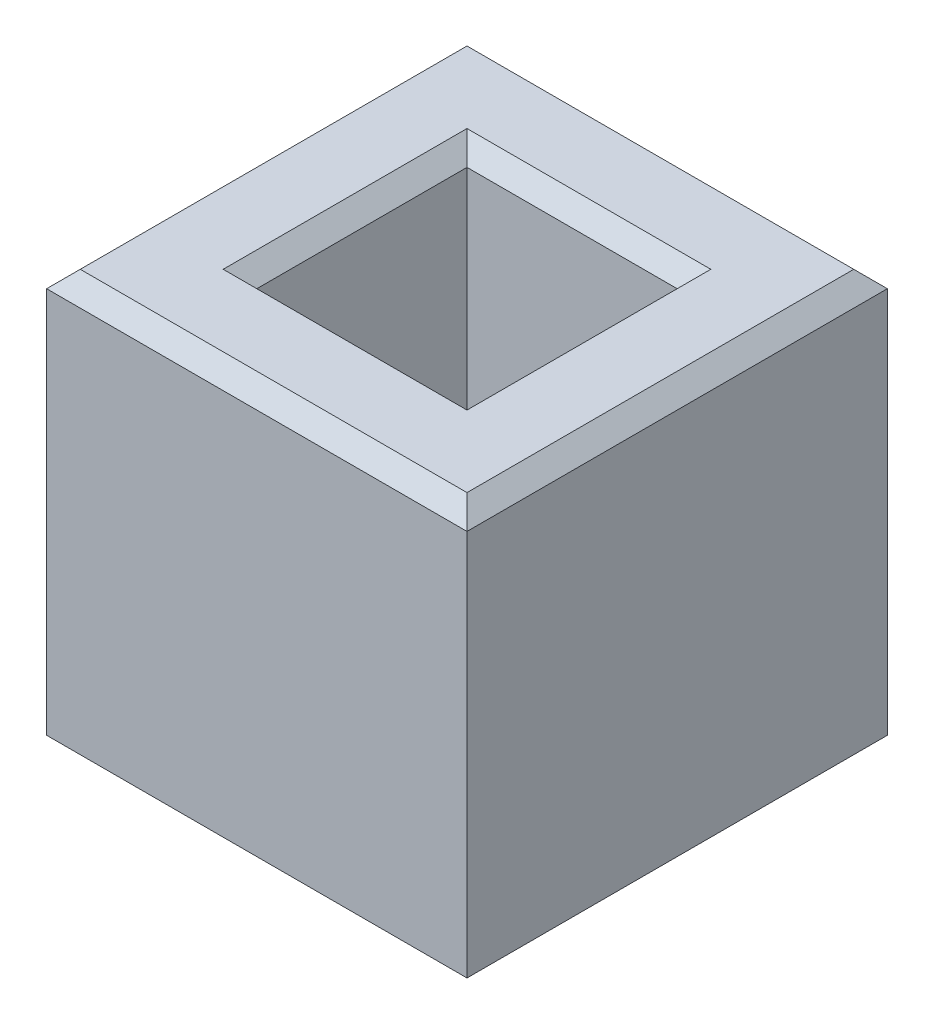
from build123d import *

# Parameters (mm, degrees)
SKETCH1_W           = 127
SKETCH1_H           = 127
BOSS_EXTRUDE1_DEPTH = 127
SKETCH2_W           = 63.5
SKETCH2_H           = 63.5
CUT_EXTRUDE1_DEPTH  = 156.542598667
CHAMFER1_SIZE       = 5.08


with BuildPart() as part:
    # Sketch1 → Boss-Extrude1 (new body)
    with BuildSketch(Plane(origin=(0, 0, 0), x_dir=(1, 0, 0), z_dir=(0, 1, 0))):
        Rectangle(SKETCH1_W, SKETCH1_H)
    extrude(amount=BOSS_EXTRUDE1_DEPTH)

    # Sketch2 → Cut-Extrude1 (cut, through all)
    with BuildSketch(Plane(origin=(0, 127, 0), x_dir=(1, 0, 0), z_dir=(0, 1, 0))):
        Rectangle(SKETCH2_W, SKETCH2_H)
    extrude(amount=-CUT_EXTRUDE1_DEPTH, mode=Mode.SUBTRACT)

    # Chamfer1
    chamfer1_edges = [part.edges().sort_by_distance(p)[0] for p in [
        (-63.5, 127, 0),
        (0, 127, 63.5),
        (31.75, 0, 0),
        (0, 0, 31.75),
        (-31.75, 0, 0),
        (0, 0, -31.75),
        (31.75, 127, 0),
        (0, 127, -31.75),
        (-31.75, 127, 0),
        (0, 127, 31.75),
        (63.5, 127, 0),
        (0, 0, 63.5),
        (-63.5, 0, 0),
        (0, 0, -63.5),
        (63.5, 0, 0),
        (0, 127, -63.5),
    ]]
    chamfer(chamfer1_edges, length=CHAMFER1_SIZE)


solid = part.part
